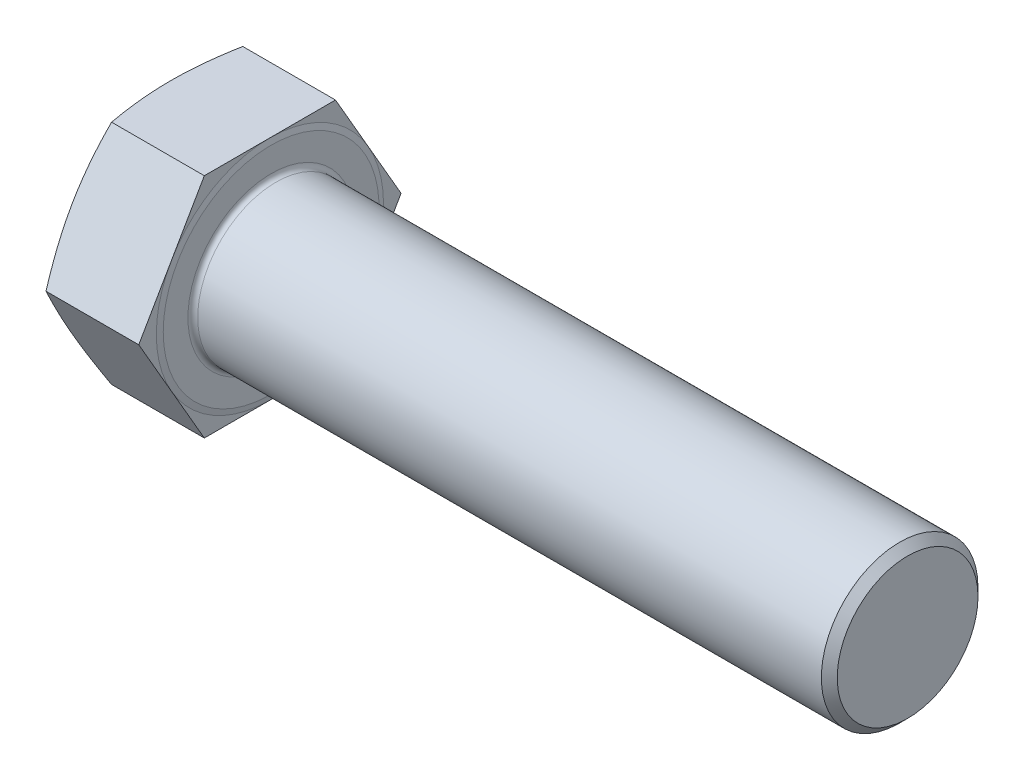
ISO-10303-21;
HEADER;
FILE_DESCRIPTION(('STEP AP214'),'2;1');
FILE_NAME('part.step','',(''),(''),'','','');
FILE_SCHEMA(('AUTOMOTIVE_DESIGN { 1 0 10303 214 1 1 1 1 }'));
ENDSEC;
DATA;
#1=APPLICATION_CONTEXT('core data for automotive mechanical design processes');
#2=APPLICATION_PROTOCOL_DEFINITION('international standard','automotive_design',2000,#1);
#3=PRODUCT_CONTEXT('',#1,'mechanical');
#4=PRODUCT('Part','Part','',(#3));
#5=PRODUCT_RELATED_PRODUCT_CATEGORY('part','',(#4));
#6=PRODUCT_DEFINITION_FORMATION('','',#4);
#7=PRODUCT_DEFINITION_CONTEXT('part definition',#1,'design');
#8=PRODUCT_DEFINITION('design','',#6,#7);
#9=PRODUCT_DEFINITION_SHAPE('','',#8);
#10=(LENGTH_UNIT() NAMED_UNIT(*) SI_UNIT(.MILLI.,.METRE.));
#11=(NAMED_UNIT(*) PLANE_ANGLE_UNIT() SI_UNIT($,.RADIAN.));
#12=(NAMED_UNIT(*) SI_UNIT($,.STERADIAN.) SOLID_ANGLE_UNIT());
#13=UNCERTAINTY_MEASURE_WITH_UNIT(LENGTH_MEASURE(1.E-05),#10,'distance_accuracy_value','');
#14=(GEOMETRIC_REPRESENTATION_CONTEXT(3) GLOBAL_UNCERTAINTY_ASSIGNED_CONTEXT((#13)) GLOBAL_UNIT_ASSIGNED_CONTEXT((#10,
#11,#12)) REPRESENTATION_CONTEXT('',''));
#15=CARTESIAN_POINT('',(0.,0.,0.));
#16=DIRECTION('',(0.,0.,1.));
#17=DIRECTION('',(1.,0.,0.));
#18=AXIS2_PLACEMENT_3D('',#15,#16,#17);
#19=CARTESIAN_POINT('',(41.,0.,0.));
#20=DIRECTION('',(1.,0.,0.));
#21=DIRECTION('',(0.,0.,-1.));
#22=AXIS2_PLACEMENT_3D('',#19,#20,#21);
#23=PLANE('',#22);
#24=CARTESIAN_POINT('',(41.,0.,0.));
#25=DIRECTION('',(1.,0.,0.));
#26=DIRECTION('',(0.,0.,-1.));
#27=AXIS2_PLACEMENT_3D('',#24,#25,#26);
#28=CIRCLE('',#27,34.);
#29=CARTESIAN_POINT('',(41.,0.,-34.));
#30=VERTEX_POINT('',#29);
#31=EDGE_CURVE('E188',#30,#30,#28,.F.);
#32=ORIENTED_EDGE('',*,*,#31,.T.);
#33=EDGE_LOOP('',(#32));
#34=FACE_BOUND('',#33,.T.);
#35=CARTESIAN_POINT('',(41.,0.,0.));
#36=DIRECTION('',(-1.,0.,0.));
#37=DIRECTION('',(0.,0.,1.));
#38=AXIS2_PLACEMENT_3D('',#35,#36,#37);
#39=CIRCLE('',#38,44.08);
#40=CARTESIAN_POINT('',(41.,0.,44.08));
#41=VERTEX_POINT('',#40);
#42=EDGE_CURVE('E138',#41,#41,#39,.T.);
#43=ORIENTED_EDGE('',*,*,#42,.F.);
#44=EDGE_LOOP('',(#43));
#45=FACE_BOUND('',#44,.T.);
#46=ADVANCED_FACE('F33',(#34,#45),#23,.T.);
#47=CARTESIAN_POINT('',(40.5,-92.8,0.));
#48=DIRECTION('',(-1.,0.,0.));
#49=DIRECTION('',(0.,0.,1.));
#50=AXIS2_PLACEMENT_3D('',#47,#48,#49);
#51=PLANE('',#50);
#52=DIRECTION('',(0.,-0.866025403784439,0.5));
#53=VECTOR('',#52,1.);
#54=CARTESIAN_POINT('',(40.5,46.4,26.7890524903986));
#55=LINE('',#54,#53);
#56=CARTESIAN_POINT('',(40.5,46.4,26.7890524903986));
#57=VERTEX_POINT('',#56);
#58=CARTESIAN_POINT('',(40.5,23.2,40.1835787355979));
#59=VERTEX_POINT('',#58);
#60=EDGE_CURVE('E137',#57,#59,#55,.T.);
#61=ORIENTED_EDGE('',*,*,#60,.T.);
#62=CARTESIAN_POINT('',(40.5,0.,0.));
#63=DIRECTION('',(-1.,0.,0.));
#64=DIRECTION('',(0.,0.,1.));
#65=AXIS2_PLACEMENT_3D('',#62,#63,#64);
#66=CIRCLE('',#65,46.4);
#67=CARTESIAN_POINT('',(40.5,46.4,0.));
#68=VERTEX_POINT('',#67);
#69=EDGE_CURVE('E49',#59,#68,#66,.T.);
#70=ORIENTED_EDGE('',*,*,#69,.T.);
#71=DIRECTION('',(0.,0.,1.));
#72=VECTOR('',#71,1.);
#73=CARTESIAN_POINT('',(40.5,46.4,-26.7890524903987));
#74=LINE('',#73,#72);
#75=EDGE_CURVE('E134',#68,#57,#74,.T.);
#76=ORIENTED_EDGE('',*,*,#75,.T.);
#77=EDGE_LOOP('',(#61,#70,#76));
#78=FACE_BOUND('',#77,.T.);
#79=ADVANCED_FACE('F133',(#78),#51,.F.);
#80=CARTESIAN_POINT('',(40.5,46.4,-26.7890524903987));
#81=VERTEX_POINT('',#80);
#82=EDGE_CURVE('E145',#81,#68,#74,.T.);
#83=ORIENTED_EDGE('',*,*,#82,.T.);
#84=CARTESIAN_POINT('',(40.5,23.2,-40.1835787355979));
#85=VERTEX_POINT('',#84);
#86=EDGE_CURVE('E121',#68,#85,#66,.T.);
#87=ORIENTED_EDGE('',*,*,#86,.T.);
#88=DIRECTION('',(0.,0.866025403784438,0.5));
#89=VECTOR('',#88,1.);
#90=CARTESIAN_POINT('',(40.5,0.,-53.5781049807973));
#91=LINE('',#90,#89);
#92=EDGE_CURVE('E151',#85,#81,#91,.T.);
#93=ORIENTED_EDGE('',*,*,#92,.T.);
#94=EDGE_LOOP('',(#83,#87,#93));
#95=FACE_BOUND('',#94,.T.);
#96=ADVANCED_FACE('F150',(#95),#51,.F.);
#97=CARTESIAN_POINT('',(40.5,0.,-53.5781049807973));
#98=VERTEX_POINT('',#97);
#99=EDGE_CURVE('E148',#98,#85,#91,.T.);
#100=ORIENTED_EDGE('',*,*,#99,.T.);
#101=CARTESIAN_POINT('',(40.5,-23.2,-40.1835787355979));
#102=VERTEX_POINT('',#101);
#103=EDGE_CURVE('E124',#85,#102,#66,.T.);
#104=ORIENTED_EDGE('',*,*,#103,.T.);
#105=DIRECTION('',(0.,0.866025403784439,-0.5));
#106=VECTOR('',#105,1.);
#107=CARTESIAN_POINT('',(40.5,-46.4,-26.7890524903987));
#108=LINE('',#107,#106);
#109=EDGE_CURVE('E348',#102,#98,#108,.T.);
#110=ORIENTED_EDGE('',*,*,#109,.T.);
#111=EDGE_LOOP('',(#100,#104,#110));
#112=FACE_BOUND('',#111,.T.);
#113=ADVANCED_FACE('F302',(#112),#51,.F.);
#114=CARTESIAN_POINT('',(40.5,-46.4,-26.7890524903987));
#115=VERTEX_POINT('',#114);
#116=EDGE_CURVE('E316',#115,#102,#108,.T.);
#117=ORIENTED_EDGE('',*,*,#116,.T.);
#118=CARTESIAN_POINT('',(40.5,-46.4,0.));
#119=VERTEX_POINT('',#118);
#120=EDGE_CURVE('E317',#102,#119,#66,.T.);
#121=ORIENTED_EDGE('',*,*,#120,.T.);
#122=DIRECTION('',(0.,0.,-1.));
#123=VECTOR('',#122,1.);
#124=CARTESIAN_POINT('',(40.5,-46.4,26.7890524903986));
#125=LINE('',#124,#123);
#126=EDGE_CURVE('E162',#119,#115,#125,.T.);
#127=ORIENTED_EDGE('',*,*,#126,.T.);
#128=EDGE_LOOP('',(#117,#121,#127));
#129=FACE_BOUND('',#128,.T.);
#130=ADVANCED_FACE('F295',(#129),#51,.F.);
#131=CARTESIAN_POINT('',(40.5,-46.4,26.7890524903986));
#132=VERTEX_POINT('',#131);
#133=EDGE_CURVE('E163',#132,#119,#125,.T.);
#134=ORIENTED_EDGE('',*,*,#133,.T.);
#135=CARTESIAN_POINT('',(40.5,-23.2,40.1835787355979));
#136=VERTEX_POINT('',#135);
#137=EDGE_CURVE('E306',#119,#136,#66,.T.);
#138=ORIENTED_EDGE('',*,*,#137,.T.);
#139=DIRECTION('',(0.,-0.866025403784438,-0.5));
#140=VECTOR('',#139,1.);
#141=CARTESIAN_POINT('',(40.5,0.,53.5781049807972));
#142=LINE('',#141,#140);
#143=EDGE_CURVE('E158',#136,#132,#142,.T.);
#144=ORIENTED_EDGE('',*,*,#143,.T.);
#145=EDGE_LOOP('',(#134,#138,#144));
#146=FACE_BOUND('',#145,.T.);
#147=ADVANCED_FACE('F287',(#146),#51,.F.);
#148=CARTESIAN_POINT('',(40.5,-46.4,-26.7890524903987));
#149=DIRECTION('',(0.,0.5,0.866025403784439));
#150=DIRECTION('',(0.,-0.866025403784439,0.5));
#151=AXIS2_PLACEMENT_3D('',#148,#149,#150);
#152=PLANE('',#151);
#153=CARTESIAN_POINT('',(2.61265857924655,0.00020000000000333,-53.5782204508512));
#154=CARTESIAN_POINT('',(2.41074770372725,-0.960669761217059,-53.0234620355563));
#155=CARTESIAN_POINT('',(2.2179233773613,-1.92300551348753,-52.4678572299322));
#156=CARTESIAN_POINT('',(1.85243292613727,-3.85063249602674,-51.354941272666));
#157=CARTESIAN_POINT('',(1.67976871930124,-4.81592399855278,-50.7976299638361));
#158=CARTESIAN_POINT('',(1.35649942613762,-6.75004117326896,-49.6809668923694));
#159=CARTESIAN_POINT('',(1.20591127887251,-7.71886898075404,-49.1216138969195));
#160=CARTESIAN_POINT('',(0.92895014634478,-9.65910086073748,-48.0014204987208));
#161=CARTESIAN_POINT('',(0.802576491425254,-10.6305048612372,-47.4405801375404));
#162=CARTESIAN_POINT('',(0.576973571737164,-12.5664327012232,-46.3228716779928));
#163=CARTESIAN_POINT('',(0.477499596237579,-13.5309350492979,-45.7660159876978));
#164=CARTESIAN_POINT('',(0.305719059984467,-15.4617674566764,-44.6512493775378));
#165=CARTESIAN_POINT('',(0.233412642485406,-16.4280975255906,-44.0933384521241));
#166=CARTESIAN_POINT('',(0.117224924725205,-18.3616916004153,-42.9769773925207));
#167=CARTESIAN_POINT('',(0.0733332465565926,-19.3289551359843,-42.4185275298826));
#168=CARTESIAN_POINT('',(0.014720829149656,-21.2641457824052,-41.3012446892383));
#169=CARTESIAN_POINT('',(0.,-22.2320728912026,-40.7424117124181));
#170=CARTESIAN_POINT('',(0.,-24.1679271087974,-39.6247457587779));
#171=CARTESIAN_POINT('',(0.0147208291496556,-25.1358542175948,-39.0659127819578));
#172=CARTESIAN_POINT('',(0.0733332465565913,-27.0710448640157,-37.9486299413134));
#173=CARTESIAN_POINT('',(0.117224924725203,-28.0383083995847,-37.3901800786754));
#174=CARTESIAN_POINT('',(0.233412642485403,-29.9719024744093,-36.2738190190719));
#175=CARTESIAN_POINT('',(0.305719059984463,-30.9382325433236,-35.7159080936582));
#176=CARTESIAN_POINT('',(0.477499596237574,-32.8690649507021,-34.6011414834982));
#177=CARTESIAN_POINT('',(0.57697357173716,-33.8335672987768,-34.0442857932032));
#178=CARTESIAN_POINT('',(0.802576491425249,-35.7694951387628,-32.9265773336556));
#179=CARTESIAN_POINT('',(0.928950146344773,-36.7408991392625,-32.3657369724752));
#180=CARTESIAN_POINT('',(1.2059112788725,-38.6811310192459,-31.2455435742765));
#181=CARTESIAN_POINT('',(1.35649942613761,-39.649958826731,-30.6861905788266));
#182=CARTESIAN_POINT('',(1.67976871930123,-41.5840760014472,-29.5695275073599));
#183=CARTESIAN_POINT('',(1.85243292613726,-42.5493675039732,-29.0122161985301));
#184=CARTESIAN_POINT('',(2.2179233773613,-44.4769944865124,-27.8993002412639));
#185=CARTESIAN_POINT('',(2.41074770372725,-45.4393302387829,-27.3436954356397));
#186=CARTESIAN_POINT('',(2.61265857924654,-46.4002,-26.7889370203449));
#187=B_SPLINE_CURVE_WITH_KNOTS('',3,(#153,#154,#155,#156,#157,#158,#159,#160,#161,#162,#163,
#164,#165,#166,#167,#168,#169,#170,#171,#172,#173,#174,#175,#176,#177,#178,#179,#180,#181,#182,
#183,#184,#185,#186),.UNSPECIFIED.,.F.,.F.,(4,2,2,2,2,2,2,2,2,2,2,2,2,2,2,2,4),(0.,
3.38323699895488,6.76679561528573,10.1529370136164,13.5389847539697,16.8931052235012,
20.2472433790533,23.6001558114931,26.9530579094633,30.3059600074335,33.6588724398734,
37.0130105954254,40.3671310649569,43.7531788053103,47.1393202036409,50.5228788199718,
53.9061158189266),.UNSPECIFIED.);
#188=CARTESIAN_POINT('',(2.61261655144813,0.,-53.5781049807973));
#189=VERTEX_POINT('',#188);
#190=CARTESIAN_POINT('',(0.,-23.2,-40.1835787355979));
#191=VERTEX_POINT('',#190);
#192=EDGE_CURVE('E332',#189,#191,#187,.T.);
#193=ORIENTED_EDGE('',*,*,#192,.F.);
#194=DIRECTION('',(-1.,0.,0.));
#195=VECTOR('',#194,1.);
#196=CARTESIAN_POINT('',(40.5,0.,-53.5781049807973));
#197=LINE('',#196,#195);
#198=EDGE_CURVE('E178',#98,#189,#197,.T.);
#199=ORIENTED_EDGE('',*,*,#198,.F.);
#200=ORIENTED_EDGE('',*,*,#109,.F.);
#201=ORIENTED_EDGE('',*,*,#116,.F.);
#202=DIRECTION('',(-1.,0.,0.));
#203=VECTOR('',#202,1.);
#204=CARTESIAN_POINT('',(40.5,-46.4,-26.7890524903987));
#205=LINE('',#204,#203);
#206=CARTESIAN_POINT('',(2.61261655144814,-46.4,-26.7890524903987));
#207=VERTEX_POINT('',#206);
#208=EDGE_CURVE('E166',#115,#207,#205,.T.);
#209=ORIENTED_EDGE('',*,*,#208,.T.);
#210=EDGE_CURVE('E245',#191,#207,#187,.T.);
#211=ORIENTED_EDGE('',*,*,#210,.F.);
#212=EDGE_LOOP('',(#193,#199,#200,#201,#209,#211));
#213=FACE_BOUND('',#212,.T.);
#214=ADVANCED_FACE('F35',(#213),#152,.F.);
#215=CARTESIAN_POINT('',(40.5,0.,-53.5781049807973));
#216=DIRECTION('',(0.,-0.5,0.866025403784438));
#217=DIRECTION('',(0.,-0.866025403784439,-0.5));
#218=AXIS2_PLACEMENT_3D('',#215,#216,#217);
#219=PLANE('',#218);
#220=CARTESIAN_POINT('',(2.61265857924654,46.4002,-26.7889370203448));
#221=CARTESIAN_POINT('',(2.41074770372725,45.4393302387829,-27.3436954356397));
#222=CARTESIAN_POINT('',(2.2179233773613,44.4769944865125,-27.8993002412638));
#223=CARTESIAN_POINT('',(1.85243292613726,42.5493675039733,-29.01221619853));
#224=CARTESIAN_POINT('',(1.67976871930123,41.5840760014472,-29.5695275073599));
#225=CARTESIAN_POINT('',(1.35649942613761,39.649958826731,-30.6861905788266));
#226=CARTESIAN_POINT('',(1.2059112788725,38.681131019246,-31.2455435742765));
#227=CARTESIAN_POINT('',(0.928950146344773,36.7408991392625,-32.3657369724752));
#228=CARTESIAN_POINT('',(0.802576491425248,35.7694951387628,-32.9265773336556));
#229=CARTESIAN_POINT('',(0.576973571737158,33.8335672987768,-34.0442857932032));
#230=CARTESIAN_POINT('',(0.477499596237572,32.8690649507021,-34.6011414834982));
#231=CARTESIAN_POINT('',(0.305719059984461,30.9382325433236,-35.7159080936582));
#232=CARTESIAN_POINT('',(0.233412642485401,29.9719024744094,-36.2738190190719));
#233=CARTESIAN_POINT('',(0.117224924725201,28.0383083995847,-37.3901800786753));
#234=CARTESIAN_POINT('',(0.0733332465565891,27.0710448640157,-37.9486299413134));
#235=CARTESIAN_POINT('',(0.014720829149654,25.1358542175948,-39.0659127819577));
#236=CARTESIAN_POINT('',(0.,24.1679271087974,-39.6247457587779));
#237=CARTESIAN_POINT('',(0.,22.2320728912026,-40.7424117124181));
#238=CARTESIAN_POINT('',(0.0147208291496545,21.2641457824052,-41.3012446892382));
#239=CARTESIAN_POINT('',(0.0733332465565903,19.3289551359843,-42.4185275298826));
#240=CARTESIAN_POINT('',(0.117224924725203,18.3616916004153,-42.9769773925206));
#241=CARTESIAN_POINT('',(0.233412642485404,16.4280975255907,-44.0933384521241));
#242=CARTESIAN_POINT('',(0.305719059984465,15.4617674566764,-44.6512493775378));
#243=CARTESIAN_POINT('',(0.477499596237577,13.5309350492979,-45.7660159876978));
#244=CARTESIAN_POINT('',(0.576973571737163,12.5664327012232,-46.3228716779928));
#245=CARTESIAN_POINT('',(0.802576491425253,10.6305048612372,-47.4405801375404));
#246=CARTESIAN_POINT('',(0.928950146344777,9.6591008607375,-48.0014204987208));
#247=CARTESIAN_POINT('',(1.2059112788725,7.71886898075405,-49.1216138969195));
#248=CARTESIAN_POINT('',(1.35649942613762,6.75004117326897,-49.6809668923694));
#249=CARTESIAN_POINT('',(1.67976871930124,4.8159239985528,-50.7976299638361));
#250=CARTESIAN_POINT('',(1.85243292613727,3.85063249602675,-51.354941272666));
#251=CARTESIAN_POINT('',(2.21792337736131,1.92300551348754,-52.4678572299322));
#252=CARTESIAN_POINT('',(2.41074770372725,0.960669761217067,-53.0234620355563));
#253=CARTESIAN_POINT('',(2.61265857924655,-0.000199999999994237,-53.5782204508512));
#254=B_SPLINE_CURVE_WITH_KNOTS('',3,(#220,#221,#222,#223,#224,#225,#226,#227,#228,#229,#230,
#231,#232,#233,#234,#235,#236,#237,#238,#239,#240,#241,#242,#243,#244,#245,#246,#247,#248,#249,
#250,#251,#252,#253),.UNSPECIFIED.,.F.,.F.,(4,2,2,2,2,2,2,2,2,2,2,2,2,2,2,2,4),(0.,
3.38323699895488,6.76679561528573,10.1529370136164,13.5389847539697,16.8931052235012,
20.2472433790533,23.6001558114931,26.9530579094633,30.3059600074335,33.6588724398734,
37.0130105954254,40.3671310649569,43.7531788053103,47.1393202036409,50.5228788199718,
53.9061158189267),.UNSPECIFIED.);
#255=CARTESIAN_POINT('',(2.61261655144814,46.4,-26.7890524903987));
#256=VERTEX_POINT('',#255);
#257=CARTESIAN_POINT('',(0.,23.2,-40.1835787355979));
#258=VERTEX_POINT('',#257);
#259=EDGE_CURVE('E260',#256,#258,#254,.T.);
#260=ORIENTED_EDGE('',*,*,#259,.F.);
#261=DIRECTION('',(-1.,0.,0.));
#262=VECTOR('',#261,1.);
#263=CARTESIAN_POINT('',(40.5,46.4,-26.7890524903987));
#264=LINE('',#263,#262);
#265=EDGE_CURVE('E176',#81,#256,#264,.T.);
#266=ORIENTED_EDGE('',*,*,#265,.F.);
#267=ORIENTED_EDGE('',*,*,#92,.F.);
#268=ORIENTED_EDGE('',*,*,#99,.F.);
#269=ORIENTED_EDGE('',*,*,#198,.T.);
#270=EDGE_CURVE('E256',#258,#189,#254,.T.);
#271=ORIENTED_EDGE('',*,*,#270,.F.);
#272=EDGE_LOOP('',(#260,#266,#267,#268,#269,#271));
#273=FACE_BOUND('',#272,.T.);
#274=ADVANCED_FACE('F266',(#273),#219,.F.);
#275=CARTESIAN_POINT('',(40.5,46.4,-26.7890524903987));
#276=DIRECTION('',(0.,-1.,0.));
#277=DIRECTION('',(0.,0.,-1.));
#278=AXIS2_PLACEMENT_3D('',#275,#276,#277);
#279=PLANE('',#278);
#280=CARTESIAN_POINT('',(13.9607867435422,46.4,-70.9279913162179));
#281=CARTESIAN_POINT('',(13.6410931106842,46.4,-69.8783553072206));
#282=CARTESIAN_POINT('',(13.3233281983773,46.4,-68.8281300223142));
#283=CARTESIAN_POINT('',(12.6920979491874,46.4,-66.7263817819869));
#284=CARTESIAN_POINT('',(12.3786326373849,46.4,-65.6748588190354));
#285=CARTESIAN_POINT('',(11.7564232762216,46.4,-63.570326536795));
#286=CARTESIAN_POINT('',(11.4476795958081,46.4,-62.5173171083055));
#287=CARTESIAN_POINT('',(10.8354623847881,46.4,-60.4097700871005));
#288=CARTESIAN_POINT('',(10.5319888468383,46.4,-59.3552324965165));
#289=CARTESIAN_POINT('',(9.62919764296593,46.4,-56.1851816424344));
#290=CARTESIAN_POINT('',(9.03867296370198,46.4,-54.0671508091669));
#291=CARTESIAN_POINT('',(7.88667290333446,46.4,-49.8232181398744));
#292=CARTESIAN_POINT('',(7.3251970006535,46.4,-47.6973164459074));
#293=CARTESIAN_POINT('',(6.24521194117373,46.4,-43.4624850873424));
#294=CARTESIAN_POINT('',(5.72625838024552,46.4,-41.3536693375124));
#295=CARTESIAN_POINT('',(4.732532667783,46.4,-37.1255461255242));
#296=CARTESIAN_POINT('',(4.25776125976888,46.4,-35.006238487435));
#297=CARTESIAN_POINT('',(3.36347119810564,46.4,-30.7566495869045));
#298=CARTESIAN_POINT('',(2.94393369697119,46.4,-28.6263723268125));
#299=CARTESIAN_POINT('',(2.17288180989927,46.4,-24.3534707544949));
#300=CARTESIAN_POINT('',(1.82136514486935,46.4,-22.2108468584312));
#301=CARTESIAN_POINT('',(1.23545507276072,46.4,-18.1544265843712));
#302=CARTESIAN_POINT('',(0.992348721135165,46.4,-16.2419085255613));
#303=CARTESIAN_POINT('',(0.683674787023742,46.4,-13.367181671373));
#304=CARTESIAN_POINT('',(0.590113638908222,46.4,-12.4079364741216));
#305=CARTESIAN_POINT('',(0.422702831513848,46.4,-10.487711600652));
#306=CARTESIAN_POINT('',(0.348853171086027,46.4,-9.52673192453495));
#307=CARTESIAN_POINT('',(0.221823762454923,46.4,-7.60407952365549));
#308=CARTESIAN_POINT('',(0.168629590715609,46.4,-6.64240775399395));
#309=CARTESIAN_POINT('',(0.083524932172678,46.4,-4.71811901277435));
#310=CARTESIAN_POINT('',(0.0516144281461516,46.4,-3.75550204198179));
#311=CARTESIAN_POINT('',(0.00950618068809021,46.4,-1.82979493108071));
#312=CARTESIAN_POINT('',(-0.000691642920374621,46.4,-0.866704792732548));
#313=CARTESIAN_POINT('',(0.000764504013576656,46.4,1.05945911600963));
#314=CARTESIAN_POINT('',(0.0124184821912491,46.4,2.02253288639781));
#315=CARTESIAN_POINT('',(0.0575333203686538,46.4,3.95305164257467));
#316=CARTESIAN_POINT('',(0.0911044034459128,46.4,4.92049404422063));
#317=CARTESIAN_POINT('',(0.179704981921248,46.4,6.85439106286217));
#318=CARTESIAN_POINT('',(0.234734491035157,46.4,7.82084567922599));
#319=CARTESIAN_POINT('',(0.365537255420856,46.4,9.75236197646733));
#320=CARTESIAN_POINT('',(0.441310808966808,46.4,10.7174236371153));
#321=CARTESIAN_POINT('',(0.612660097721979,46.4,12.6457680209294));
#322=CARTESIAN_POINT('',(0.70823585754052,46.4,13.6090507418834));
#323=CARTESIAN_POINT('',(1.02322637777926,46.4,16.4974553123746));
#324=CARTESIAN_POINT('',(1.27079544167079,46.4,18.4195733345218));
#325=CARTESIAN_POINT('',(1.69096161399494,46.4,21.2953976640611));
#326=CARTESIAN_POINT('',(1.83915525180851,46.4,22.2527958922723));
#327=CARTESIAN_POINT('',(2.15053663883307,46.4,24.1651663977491));
#328=CARTESIAN_POINT('',(2.31372449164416,46.4,25.1201386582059));
#329=CARTESIAN_POINT('',(2.84186736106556,46.4,28.0822254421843));
#330=CARTESIAN_POINT('',(3.23040458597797,46.4,30.0851524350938));
#331=CARTESIAN_POINT('',(4.05747679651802,46.4,34.0806847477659));
#332=CARTESIAN_POINT('',(4.496015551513,46.4,36.073289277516));
#333=CARTESIAN_POINT('',(5.41389304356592,46.4,40.0496426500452));
#334=CARTESIAN_POINT('',(5.89324362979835,46.4,42.0333887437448));
#335=CARTESIAN_POINT('',(6.88494431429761,46.4,45.9925217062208));
#336=CARTESIAN_POINT('',(7.39729362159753,46.4,47.9679087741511));
#337=CARTESIAN_POINT('',(8.4494994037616,46.4,51.9140353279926));
#338=CARTESIAN_POINT('',(8.98939035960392,46.4,53.8847655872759));
#339=CARTESIAN_POINT('',(10.0911344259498,46.4,57.8200689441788));
#340=CARTESIAN_POINT('',(10.6529876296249,46.4,59.7846420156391));
#341=CARTESIAN_POINT('',(11.7946364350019,46.4,63.7081990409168));
#342=CARTESIAN_POINT('',(12.3744290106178,46.4,65.6671838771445));
#343=CARTESIAN_POINT('',(13.5489293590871,46.4,69.5806651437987));
#344=CARTESIAN_POINT('',(14.1436371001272,46.4,71.5351615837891));
#345=CARTESIAN_POINT('',(15.3388489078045,46.4,75.4187660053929));
#346=CARTESIAN_POINT('',(15.9392164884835,46.4,77.3479160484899));
#347=CARTESIAN_POINT('',(17.1501784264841,46.4,81.2030006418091));
#348=CARTESIAN_POINT('',(17.7607727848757,46.4,83.1289351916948));
#349=CARTESIAN_POINT('',(18.9906524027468,46.4,86.9781223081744));
#350=CARTESIAN_POINT('',(19.609938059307,46.4,88.9013747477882));
#351=CARTESIAN_POINT('',(20.8558989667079,46.4,92.7454849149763));
#352=CARTESIAN_POINT('',(21.4825742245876,46.4,94.6663426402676));
#353=CARTESIAN_POINT('',(22.739876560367,46.4,98.498688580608));
#354=CARTESIAN_POINT('',(23.3704796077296,46.4,100.410184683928));
#355=CARTESIAN_POINT('',(24.6371273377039,46.4,104.231373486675));
#356=CARTESIAN_POINT('',(25.2731720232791,46.4,106.14106618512));
#357=CARTESIAN_POINT('',(26.5499335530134,46.4,109.958714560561));
#358=CARTESIAN_POINT('',(27.1906500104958,46.4,111.866670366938));
#359=CARTESIAN_POINT('',(28.4762287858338,46.4,115.68117978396));
#360=CARTESIAN_POINT('',(29.1210910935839,46.4,117.587733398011));
#361=CARTESIAN_POINT('',(29.767739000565,46.4,119.493679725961));
#362=B_SPLINE_CURVE_WITH_KNOTS('',3,(#280,#281,#282,#283,#284,#285,#286,#287,#288,#289,#290,
#291,#292,#293,#294,#295,#296,#297,#298,#299,#300,#301,#302,#303,#304,#305,#306,#307,#308,#309,
#310,#311,#312,#313,#314,#315,#316,#317,#318,#319,#320,#321,#322,#323,#324,#325,#326,#327,#328,
#329,#330,#331,#332,#333,#334,#335,#336,#337,#338,#339,#340,#341,#342,#343,#344,#345,#346,#347,
#348,#349,#350,#351,#352,#353,#354,#355,#356,#357,#358,#359,#360,#361),.UNSPECIFIED.,.F.,.F.,(4,
2,2,2,2,2,2,2,2,2,2,2,2,2,2,2,2,2,2,2,2,2,2,2,2,2,2,2,2,2,2,2,2,2,2,2,2,2,2,2,4),(0.,
3.29172629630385,6.58347178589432,9.87547319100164,13.1674700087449,19.763731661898,
26.3598748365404,32.8746910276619,39.38961683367,45.9023137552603,52.4147924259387,
58.1970981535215,61.0883188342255,63.9795393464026,66.8687372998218,69.7579329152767,
72.6471178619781,75.5363038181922,78.4401328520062,81.3439637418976,84.2478363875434,
87.1517126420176,92.9641539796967,95.8704695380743,98.7768051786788,104.896726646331,
111.017109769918,117.139275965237,123.261295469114,129.391177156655,135.52108485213,
141.649964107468,147.778830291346,153.840030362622,159.901231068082,165.962709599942,
172.024193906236,178.062669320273,184.101148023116,190.139132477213,196.177102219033),.UNSPECIFIED.);
#363=CARTESIAN_POINT('',(2.61261655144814,46.4000000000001,26.7890524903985));
#364=VERTEX_POINT('',#363);
#365=CARTESIAN_POINT('',(0.,46.4,0.));
#366=VERTEX_POINT('',#365);
#367=EDGE_CURVE('E349',#364,#366,#362,.F.);
#368=ORIENTED_EDGE('',*,*,#367,.F.);
#369=DIRECTION('',(-1.,0.,0.));
#370=VECTOR('',#369,1.);
#371=CARTESIAN_POINT('',(40.5,46.4,26.7890524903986));
#372=LINE('',#371,#370);
#373=EDGE_CURVE('E147',#57,#364,#372,.T.);
#374=ORIENTED_EDGE('',*,*,#373,.F.);
#375=ORIENTED_EDGE('',*,*,#75,.F.);
#376=ORIENTED_EDGE('',*,*,#82,.F.);
#377=ORIENTED_EDGE('',*,*,#265,.T.);
#378=EDGE_CURVE('E261',#366,#256,#362,.F.);
#379=ORIENTED_EDGE('',*,*,#378,.F.);
#380=EDGE_LOOP('',(#368,#374,#375,#376,#377,#379));
#381=FACE_BOUND('',#380,.T.);
#382=ADVANCED_FACE('F143',(#381),#279,.F.);
#383=CARTESIAN_POINT('',(40.5,46.4,26.7890524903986));
#384=DIRECTION('',(0.,-0.5,-0.866025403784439));
#385=DIRECTION('',(0.,0.866025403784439,-0.5));
#386=AXIS2_PLACEMENT_3D('',#383,#384,#385);
#387=PLANE('',#386);
#388=CARTESIAN_POINT('',(2.61265857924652,-0.000200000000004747,53.5782204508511));
#389=CARTESIAN_POINT('',(2.41074770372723,0.960669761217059,53.0234620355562));
#390=CARTESIAN_POINT('',(2.21792337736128,1.92300551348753,52.4678572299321));
#391=CARTESIAN_POINT('',(1.85243292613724,3.85063249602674,51.3549412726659));
#392=CARTESIAN_POINT('',(1.67976871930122,4.81592399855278,50.797629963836));
#393=CARTESIAN_POINT('',(1.3564994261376,6.75004117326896,49.6809668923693));
#394=CARTESIAN_POINT('',(1.20591127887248,7.71886898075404,49.1216138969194));
#395=CARTESIAN_POINT('',(0.928950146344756,9.65910086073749,48.0014204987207));
#396=CARTESIAN_POINT('',(0.80257649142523,10.6305048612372,47.4405801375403));
#397=CARTESIAN_POINT('',(0.57697357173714,12.5664327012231,46.3228716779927));
#398=CARTESIAN_POINT('',(0.477499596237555,13.5309350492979,45.7660159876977));
#399=CARTESIAN_POINT('',(0.305719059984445,15.4617674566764,44.6512493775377));
#400=CARTESIAN_POINT('',(0.233412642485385,16.4280975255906,44.0933384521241));
#401=CARTESIAN_POINT('',(0.117224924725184,18.3616916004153,42.9769773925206));
#402=CARTESIAN_POINT('',(0.0733332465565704,19.3289551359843,42.4185275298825));
#403=CARTESIAN_POINT('',(0.0147208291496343,21.2641457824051,41.3012446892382));
#404=CARTESIAN_POINT('',(0.,22.2320728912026,40.742411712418));
#405=CARTESIAN_POINT('',(0.,24.1679271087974,39.6247457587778));
#406=CARTESIAN_POINT('',(0.0147208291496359,25.1358542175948,39.0659127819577));
#407=CARTESIAN_POINT('',(0.0733332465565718,27.0710448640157,37.9486299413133));
#408=CARTESIAN_POINT('',(0.117224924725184,28.0383083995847,37.3901800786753));
#409=CARTESIAN_POINT('',(0.233412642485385,29.9719024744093,36.2738190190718));
#410=CARTESIAN_POINT('',(0.305719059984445,30.9382325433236,35.7159080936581));
#411=CARTESIAN_POINT('',(0.477499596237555,32.8690649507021,34.6011414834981));
#412=CARTESIAN_POINT('',(0.57697357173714,33.8335672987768,34.0442857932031));
#413=CARTESIAN_POINT('',(0.80257649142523,35.7694951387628,32.9265773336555));
#414=CARTESIAN_POINT('',(0.928950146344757,36.7408991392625,32.3657369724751));
#415=CARTESIAN_POINT('',(1.20591127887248,38.6811310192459,31.2455435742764));
#416=CARTESIAN_POINT('',(1.3564994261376,39.649958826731,30.6861905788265));
#417=CARTESIAN_POINT('',(1.67976871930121,41.5840760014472,29.5695275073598));
#418=CARTESIAN_POINT('',(1.85243292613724,42.5493675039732,29.01221619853));
#419=CARTESIAN_POINT('',(2.21792337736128,44.4769944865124,27.8993002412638));
#420=CARTESIAN_POINT('',(2.41074770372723,45.4393302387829,27.3436954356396));
#421=CARTESIAN_POINT('',(2.61265857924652,46.4002,26.7889370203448));
#422=B_SPLINE_CURVE_WITH_KNOTS('',3,(#388,#389,#390,#391,#392,#393,#394,#395,#396,#397,#398,
#399,#400,#401,#402,#403,#404,#405,#406,#407,#408,#409,#410,#411,#412,#413,#414,#415,#416,#417,
#418,#419,#420,#421),.UNSPECIFIED.,.F.,.F.,(4,2,2,2,2,2,2,2,2,2,2,2,2,2,2,2,4),(0.,
3.38323699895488,6.76679561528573,10.1529370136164,13.5389847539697,16.8931052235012,
20.2472433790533,23.6001558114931,26.9530579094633,30.3059600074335,33.6588724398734,
37.0130105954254,40.3671310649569,43.7531788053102,47.1393202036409,50.5228788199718,
53.9061158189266),.UNSPECIFIED.);
#423=CARTESIAN_POINT('',(2.61261655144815,1.45716771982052E-13,53.5781049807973));
#424=VERTEX_POINT('',#423);
#425=CARTESIAN_POINT('',(0.,23.2,40.183578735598));
#426=VERTEX_POINT('',#425);
#427=EDGE_CURVE('E250',#424,#426,#422,.T.);
#428=ORIENTED_EDGE('',*,*,#427,.F.);
#429=DIRECTION('',(-1.,0.,0.));
#430=VECTOR('',#429,1.);
#431=CARTESIAN_POINT('',(40.5,0.,53.5781049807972));
#432=LINE('',#431,#430);
#433=CARTESIAN_POINT('',(40.5,0.,53.5781049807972));
#434=VERTEX_POINT('',#433);
#435=EDGE_CURVE('E172',#434,#424,#432,.T.);
#436=ORIENTED_EDGE('',*,*,#435,.F.);
#437=EDGE_CURVE('E153',#59,#434,#55,.T.);
#438=ORIENTED_EDGE('',*,*,#437,.F.);
#439=ORIENTED_EDGE('',*,*,#60,.F.);
#440=ORIENTED_EDGE('',*,*,#373,.T.);
#441=EDGE_CURVE('E335',#426,#364,#422,.T.);
#442=ORIENTED_EDGE('',*,*,#441,.F.);
#443=EDGE_LOOP('',(#428,#436,#438,#439,#440,#442));
#444=FACE_BOUND('',#443,.T.);
#445=ADVANCED_FACE('F272',(#444),#387,.F.);
#446=CARTESIAN_POINT('',(40.5,0.,53.5781049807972));
#447=DIRECTION('',(0.,0.5,-0.866025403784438));
#448=DIRECTION('',(0.,0.866025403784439,0.5));
#449=AXIS2_PLACEMENT_3D('',#446,#447,#448);
#450=PLANE('',#449);
#451=CARTESIAN_POINT('',(2.61265857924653,-46.4002,26.7889370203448));
#452=CARTESIAN_POINT('',(2.41074770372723,-45.4393302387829,27.3436954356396));
#453=CARTESIAN_POINT('',(2.21792337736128,-44.4769944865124,27.8993002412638));
#454=CARTESIAN_POINT('',(1.85243292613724,-42.5493675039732,29.01221619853));
#455=CARTESIAN_POINT('',(1.67976871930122,-41.5840760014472,29.5695275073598));
#456=CARTESIAN_POINT('',(1.3564994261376,-39.649958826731,30.6861905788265));
#457=CARTESIAN_POINT('',(1.20591127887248,-38.6811310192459,31.2455435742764));
#458=CARTESIAN_POINT('',(0.928950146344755,-36.7408991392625,32.3657369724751));
#459=CARTESIAN_POINT('',(0.802576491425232,-35.7694951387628,32.9265773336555));
#460=CARTESIAN_POINT('',(0.576973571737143,-33.8335672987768,34.0442857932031));
#461=CARTESIAN_POINT('',(0.477499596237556,-32.8690649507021,34.6011414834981));
#462=CARTESIAN_POINT('',(0.305719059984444,-30.9382325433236,35.7159080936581));
#463=CARTESIAN_POINT('',(0.233412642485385,-29.9719024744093,36.2738190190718));
#464=CARTESIAN_POINT('',(0.117224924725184,-28.0383083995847,37.3901800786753));
#465=CARTESIAN_POINT('',(0.0733332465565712,-27.0710448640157,37.9486299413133));
#466=CARTESIAN_POINT('',(0.0147208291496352,-25.1358542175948,39.0659127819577));
#467=CARTESIAN_POINT('',(0.,-24.1679271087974,39.6247457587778));
#468=CARTESIAN_POINT('',(0.,-22.2320728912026,40.742411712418));
#469=CARTESIAN_POINT('',(0.0147208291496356,-21.2641457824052,41.3012446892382));
#470=CARTESIAN_POINT('',(0.0733332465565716,-19.3289551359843,42.4185275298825));
#471=CARTESIAN_POINT('',(0.117224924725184,-18.3616916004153,42.9769773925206));
#472=CARTESIAN_POINT('',(0.233412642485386,-16.4280975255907,44.0933384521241));
#473=CARTESIAN_POINT('',(0.305719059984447,-15.4617674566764,44.6512493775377));
#474=CARTESIAN_POINT('',(0.477499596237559,-13.5309350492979,45.7660159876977));
#475=CARTESIAN_POINT('',(0.576973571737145,-12.5664327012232,46.3228716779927));
#476=CARTESIAN_POINT('',(0.802576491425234,-10.6305048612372,47.4405801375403));
#477=CARTESIAN_POINT('',(0.928950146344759,-9.65910086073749,48.0014204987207));
#478=CARTESIAN_POINT('',(1.20591127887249,-7.71886898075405,49.1216138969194));
#479=CARTESIAN_POINT('',(1.3564994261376,-6.75004117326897,49.6809668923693));
#480=CARTESIAN_POINT('',(1.67976871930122,-4.81592399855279,50.797629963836));
#481=CARTESIAN_POINT('',(1.85243292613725,-3.85063249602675,51.3549412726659));
#482=CARTESIAN_POINT('',(2.21792337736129,-1.92300551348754,52.4678572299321));
#483=CARTESIAN_POINT('',(2.41074770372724,-0.960669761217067,53.0234620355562));
#484=CARTESIAN_POINT('',(2.61265857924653,0.000199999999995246,53.5782204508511));
#485=B_SPLINE_CURVE_WITH_KNOTS('',3,(#451,#452,#453,#454,#455,#456,#457,#458,#459,#460,#461,
#462,#463,#464,#465,#466,#467,#468,#469,#470,#471,#472,#473,#474,#475,#476,#477,#478,#479,#480,
#481,#482,#483,#484),.UNSPECIFIED.,.F.,.F.,(4,2,2,2,2,2,2,2,2,2,2,2,2,2,2,2,4),(0.,
3.38323699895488,6.76679561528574,10.1529370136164,13.5389847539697,16.8931052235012,
20.2472433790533,23.6001558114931,26.9530579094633,30.3059600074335,33.6588724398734,
37.0130105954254,40.367131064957,43.7531788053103,47.1393202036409,50.5228788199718,
53.9061158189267),.UNSPECIFIED.);
#486=CARTESIAN_POINT('',(2.61261655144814,-46.4,26.7890524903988));
#487=VERTEX_POINT('',#486);
#488=CARTESIAN_POINT('',(0.,-23.2,40.1835787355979));
#489=VERTEX_POINT('',#488);
#490=EDGE_CURVE('E238',#487,#489,#485,.T.);
#491=ORIENTED_EDGE('',*,*,#490,.F.);
#492=DIRECTION('',(-1.,0.,0.));
#493=VECTOR('',#492,1.);
#494=CARTESIAN_POINT('',(40.5,-46.4,26.7890524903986));
#495=LINE('',#494,#493);
#496=EDGE_CURVE('E169',#132,#487,#495,.T.);
#497=ORIENTED_EDGE('',*,*,#496,.F.);
#498=ORIENTED_EDGE('',*,*,#143,.F.);
#499=EDGE_CURVE('E159',#434,#136,#142,.T.);
#500=ORIENTED_EDGE('',*,*,#499,.F.);
#501=ORIENTED_EDGE('',*,*,#435,.T.);
#502=EDGE_CURVE('E330',#489,#424,#485,.T.);
#503=ORIENTED_EDGE('',*,*,#502,.F.);
#504=EDGE_LOOP('',(#491,#497,#498,#500,#501,#503));
#505=FACE_BOUND('',#504,.T.);
#506=ADVANCED_FACE('F275',(#505),#450,.F.);
#507=CARTESIAN_POINT('',(40.5,-46.4,26.7890524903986));
#508=DIRECTION('',(0.,1.,0.));
#509=DIRECTION('',(0.,0.,1.));
#510=AXIS2_PLACEMENT_3D('',#507,#508,#509);
#511=PLANE('',#510);
#512=CARTESIAN_POINT('',(13.9607867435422,-46.4,-70.927991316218));
#513=CARTESIAN_POINT('',(13.6410931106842,-46.4,-69.8783553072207));
#514=CARTESIAN_POINT('',(13.3233281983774,-46.4,-68.8281300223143));
#515=CARTESIAN_POINT('',(12.6920979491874,-46.4,-66.726381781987));
#516=CARTESIAN_POINT('',(12.378632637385,-46.4,-65.6748588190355));
#517=CARTESIAN_POINT('',(11.7564232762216,-46.4,-63.5703265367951));
#518=CARTESIAN_POINT('',(11.4476795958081,-46.4,-62.5173171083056));
#519=CARTESIAN_POINT('',(10.8354623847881,-46.4,-60.4097700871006));
#520=CARTESIAN_POINT('',(10.5319888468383,-46.4,-59.3552324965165));
#521=CARTESIAN_POINT('',(9.62919764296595,-46.4,-56.1851816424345));
#522=CARTESIAN_POINT('',(9.03867296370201,-46.4,-54.067150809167));
#523=CARTESIAN_POINT('',(7.88667290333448,-46.4,-49.8232181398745));
#524=CARTESIAN_POINT('',(7.32519700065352,-46.4,-47.6973164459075));
#525=CARTESIAN_POINT('',(6.24521194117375,-46.4,-43.4624850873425));
#526=CARTESIAN_POINT('',(5.72625838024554,-46.4,-41.3536693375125));
#527=CARTESIAN_POINT('',(4.73253266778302,-46.4,-37.1255461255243));
#528=CARTESIAN_POINT('',(4.25776125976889,-46.4,-35.006238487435));
#529=CARTESIAN_POINT('',(3.36347119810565,-46.4,-30.7566495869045));
#530=CARTESIAN_POINT('',(2.9439336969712,-46.4,-28.6263723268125));
#531=CARTESIAN_POINT('',(2.17288180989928,-46.4,-24.3534707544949));
#532=CARTESIAN_POINT('',(1.82136514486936,-46.4,-22.2108468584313));
#533=CARTESIAN_POINT('',(1.23545507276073,-46.4,-18.1544265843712));
#534=CARTESIAN_POINT('',(0.992348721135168,-46.4,-16.2419085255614));
#535=CARTESIAN_POINT('',(0.683674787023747,-46.4,-13.367181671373));
#536=CARTESIAN_POINT('',(0.590113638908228,-46.4,-12.4079364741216));
#537=CARTESIAN_POINT('',(0.422702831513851,-46.4,-10.4877116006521));
#538=CARTESIAN_POINT('',(0.348853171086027,-46.4,-9.52673192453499));
#539=CARTESIAN_POINT('',(0.221823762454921,-46.4,-7.60407952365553));
#540=CARTESIAN_POINT('',(0.168629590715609,-46.4,-6.64240775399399));
#541=CARTESIAN_POINT('',(0.0835249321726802,-46.4,-4.71811901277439));
#542=CARTESIAN_POINT('',(0.0516144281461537,-46.4,-3.75550204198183));
#543=CARTESIAN_POINT('',(0.00950618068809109,-46.4,-1.82979493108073));
#544=CARTESIAN_POINT('',(-0.000691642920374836,-46.4,-0.866704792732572));
#545=CARTESIAN_POINT('',(0.000764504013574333,-46.4,1.05945911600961));
#546=CARTESIAN_POINT('',(0.0124184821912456,-46.4,2.02253288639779));
#547=CARTESIAN_POINT('',(0.0575333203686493,-46.4,3.95305164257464));
#548=CARTESIAN_POINT('',(0.0911044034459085,-46.4,4.92049404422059));
#549=CARTESIAN_POINT('',(0.179704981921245,-46.4,6.85439106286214));
#550=CARTESIAN_POINT('',(0.234734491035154,-46.4,7.82084567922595));
#551=CARTESIAN_POINT('',(0.365537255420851,-46.4,9.75236197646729));
#552=CARTESIAN_POINT('',(0.441310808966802,-46.4,10.7174236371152));
#553=CARTESIAN_POINT('',(0.612660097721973,-46.4,12.6457680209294));
#554=CARTESIAN_POINT('',(0.708235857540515,-46.4,13.6090507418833));
#555=CARTESIAN_POINT('',(1.02322637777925,-46.4,16.4974553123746));
#556=CARTESIAN_POINT('',(1.27079544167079,-46.4,18.4195733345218));
#557=CARTESIAN_POINT('',(1.69096161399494,-46.4,21.2953976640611));
#558=CARTESIAN_POINT('',(1.83915525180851,-46.4,22.2527958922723));
#559=CARTESIAN_POINT('',(2.15053663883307,-46.4,24.165166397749));
#560=CARTESIAN_POINT('',(2.31372449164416,-46.4,25.1201386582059));
#561=CARTESIAN_POINT('',(2.84186736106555,-46.4,28.0822254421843));
#562=CARTESIAN_POINT('',(3.23040458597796,-46.4,30.0851524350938));
#563=CARTESIAN_POINT('',(4.05747679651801,-46.4,34.0806847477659));
#564=CARTESIAN_POINT('',(4.496015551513,-46.4,36.073289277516));
#565=CARTESIAN_POINT('',(5.41389304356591,-46.4,40.0496426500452));
#566=CARTESIAN_POINT('',(5.89324362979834,-46.4,42.0333887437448));
#567=CARTESIAN_POINT('',(6.88494431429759,-46.4,45.9925217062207));
#568=CARTESIAN_POINT('',(7.39729362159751,-46.4,47.9679087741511));
#569=CARTESIAN_POINT('',(8.44949940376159,-46.4,51.9140353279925));
#570=CARTESIAN_POINT('',(8.9893903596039,-46.4,53.8847655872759));
#571=CARTESIAN_POINT('',(10.0911344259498,-46.4,57.8200689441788));
#572=CARTESIAN_POINT('',(10.6529876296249,-46.4,59.7846420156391));
#573=CARTESIAN_POINT('',(11.7946364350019,-46.4,63.7081990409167));
#574=CARTESIAN_POINT('',(12.3744290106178,-46.4,65.6671838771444));
#575=CARTESIAN_POINT('',(13.5489293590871,-46.4,69.5806651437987));
#576=CARTESIAN_POINT('',(14.1436371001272,-46.4,71.535161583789));
#577=CARTESIAN_POINT('',(15.3388489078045,-46.4,75.4187660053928));
#578=CARTESIAN_POINT('',(15.9392164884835,-46.4,77.3479160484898));
#579=CARTESIAN_POINT('',(17.1501784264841,-46.4,81.203000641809));
#580=CARTESIAN_POINT('',(17.7607727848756,-46.4,83.1289351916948));
#581=CARTESIAN_POINT('',(18.9906524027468,-46.4,86.9781223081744));
#582=CARTESIAN_POINT('',(19.609938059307,-46.4,88.9013747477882));
#583=CARTESIAN_POINT('',(20.8558989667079,-46.4,92.7454849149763));
#584=CARTESIAN_POINT('',(21.4825742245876,-46.4,94.6663426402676));
#585=CARTESIAN_POINT('',(22.7398765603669,-46.4,98.4986885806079));
#586=CARTESIAN_POINT('',(23.3704796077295,-46.4,100.410184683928));
#587=CARTESIAN_POINT('',(24.6371273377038,-46.4,104.231373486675));
#588=CARTESIAN_POINT('',(25.2731720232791,-46.4,106.14106618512));
#589=CARTESIAN_POINT('',(26.5499335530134,-46.4,109.958714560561));
#590=CARTESIAN_POINT('',(27.1906500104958,-46.4,111.866670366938));
#591=CARTESIAN_POINT('',(28.4762287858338,-46.4,115.68117978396));
#592=CARTESIAN_POINT('',(29.1210910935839,-46.4,117.587733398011));
#593=CARTESIAN_POINT('',(29.767739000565,-46.4,119.493679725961));
#594=B_SPLINE_CURVE_WITH_KNOTS('',3,(#512,#513,#514,#515,#516,#517,#518,#519,#520,#521,#522,
#523,#524,#525,#526,#527,#528,#529,#530,#531,#532,#533,#534,#535,#536,#537,#538,#539,#540,#541,
#542,#543,#544,#545,#546,#547,#548,#549,#550,#551,#552,#553,#554,#555,#556,#557,#558,#559,#560,
#561,#562,#563,#564,#565,#566,#567,#568,#569,#570,#571,#572,#573,#574,#575,#576,#577,#578,#579,
#580,#581,#582,#583,#584,#585,#586,#587,#588,#589,#590,#591,#592,#593),.UNSPECIFIED.,.F.,.F.,(4,
2,2,2,2,2,2,2,2,2,2,2,2,2,2,2,2,2,2,2,2,2,2,2,2,2,2,2,2,2,2,2,2,2,2,2,2,2,2,2,4),(0.,
3.29172629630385,6.58347178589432,9.87547319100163,13.1674700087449,19.763731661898,
26.3598748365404,32.874691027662,39.38961683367,45.9023137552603,52.4147924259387,
58.1970981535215,61.0883188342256,63.9795393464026,66.8687372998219,69.7579329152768,
72.6471178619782,75.5363038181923,78.4401328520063,81.3439637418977,84.2478363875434,
87.1517126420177,92.9641539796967,95.8704695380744,98.7768051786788,104.896726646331,
111.017109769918,117.139275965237,123.261295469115,129.391177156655,135.52108485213,
141.649964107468,147.778830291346,153.840030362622,159.901231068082,165.962709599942,
172.024193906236,178.062669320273,184.101148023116,190.139132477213,196.177102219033),.UNSPECIFIED.);
#595=CARTESIAN_POINT('',(0.,-46.4,0.));
#596=VERTEX_POINT('',#595);
#597=EDGE_CURVE('E323',#207,#596,#594,.T.);
#598=ORIENTED_EDGE('',*,*,#597,.F.);
#599=ORIENTED_EDGE('',*,*,#208,.F.);
#600=ORIENTED_EDGE('',*,*,#126,.F.);
#601=ORIENTED_EDGE('',*,*,#133,.F.);
#602=ORIENTED_EDGE('',*,*,#496,.T.);
#603=EDGE_CURVE('E228',#596,#487,#594,.T.);
#604=ORIENTED_EDGE('',*,*,#603,.F.);
#605=EDGE_LOOP('',(#598,#599,#600,#601,#602,#604));
#606=FACE_BOUND('',#605,.T.);
#607=ADVANCED_FACE('F279',(#606),#511,.F.);
#608=ORIENTED_EDGE('',*,*,#499,.T.);
#609=EDGE_CURVE('E139',#136,#59,#66,.T.);
#610=ORIENTED_EDGE('',*,*,#609,.T.);
#611=ORIENTED_EDGE('',*,*,#437,.T.);
#612=EDGE_LOOP('',(#608,#610,#611));
#613=FACE_BOUND('',#612,.T.);
#614=ADVANCED_FACE('F213',(#613),#51,.F.);
#615=CARTESIAN_POINT('',(0.,0.,0.));
#616=DIRECTION('',(1.,0.,0.));
#617=DIRECTION('',(0.,0.,-1.));
#618=AXIS2_PLACEMENT_3D('',#615,#616,#617);
#619=CONICAL_SURFACE('',#618,46.4,1.22173047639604);
#620=ORIENTED_EDGE('',*,*,#427,.T.);
#621=CARTESIAN_POINT('',(0.,0.,0.));
#622=DIRECTION('',(-1.,0.,0.));
#623=DIRECTION('',(0.,0.,1.));
#624=AXIS2_PLACEMENT_3D('',#621,#622,#623);
#625=CIRCLE('',#624,46.4);
#626=EDGE_CURVE('E181',#489,#426,#625,.T.);
#627=ORIENTED_EDGE('',*,*,#626,.F.);
#628=ORIENTED_EDGE('',*,*,#502,.T.);
#629=EDGE_LOOP('',(#620,#627,#628));
#630=FACE_BOUND('',#629,.T.);
#631=ADVANCED_FACE('F285',(#630),#619,.T.);
#632=ORIENTED_EDGE('',*,*,#490,.T.);
#633=EDGE_CURVE('E184',#596,#489,#625,.T.);
#634=ORIENTED_EDGE('',*,*,#633,.F.);
#635=ORIENTED_EDGE('',*,*,#603,.T.);
#636=EDGE_LOOP('',(#632,#634,#635));
#637=FACE_BOUND('',#636,.T.);
#638=ADVANCED_FACE('F224',(#637),#619,.T.);
#639=ORIENTED_EDGE('',*,*,#210,.T.);
#640=ORIENTED_EDGE('',*,*,#597,.T.);
#641=EDGE_CURVE('E344',#191,#596,#625,.T.);
#642=ORIENTED_EDGE('',*,*,#641,.F.);
#643=EDGE_LOOP('',(#639,#640,#642));
#644=FACE_BOUND('',#643,.T.);
#645=ADVANCED_FACE('F292',(#644),#619,.T.);
#646=ORIENTED_EDGE('',*,*,#270,.T.);
#647=ORIENTED_EDGE('',*,*,#192,.T.);
#648=EDGE_CURVE('E340',#258,#191,#625,.T.);
#649=ORIENTED_EDGE('',*,*,#648,.F.);
#650=EDGE_LOOP('',(#646,#647,#649));
#651=FACE_BOUND('',#650,.T.);
#652=ADVANCED_FACE('F293',(#651),#619,.T.);
#653=ORIENTED_EDGE('',*,*,#378,.T.);
#654=ORIENTED_EDGE('',*,*,#259,.T.);
#655=EDGE_CURVE('E185',#366,#258,#625,.T.);
#656=ORIENTED_EDGE('',*,*,#655,.F.);
#657=EDGE_LOOP('',(#653,#654,#656));
#658=FACE_BOUND('',#657,.T.);
#659=ADVANCED_FACE('F223',(#658),#619,.T.);
#660=ORIENTED_EDGE('',*,*,#367,.T.);
#661=CARTESIAN_POINT('',(0.,0.,0.));
#662=DIRECTION('',(-1.,0.,0.));
#663=DIRECTION('',(0.,0.,1.));
#664=AXIS2_PLACEMENT_3D('',#661,#662,#663);
#665=CIRCLE('',#664,46.4);
#666=EDGE_CURVE('E57',#426,#366,#665,.T.);
#667=ORIENTED_EDGE('',*,*,#666,.F.);
#668=ORIENTED_EDGE('',*,*,#441,.T.);
#669=EDGE_LOOP('',(#660,#667,#668));
#670=FACE_BOUND('',#669,.T.);
#671=ADVANCED_FACE('F218',(#670),#619,.T.);
#672=CARTESIAN_POINT('',(0.,-92.8,0.));
#673=DIRECTION('',(-1.,0.,0.));
#674=DIRECTION('',(0.,0.,1.));
#675=AXIS2_PLACEMENT_3D('',#672,#673,#674);
#676=PLANE('',#675);
#677=ORIENTED_EDGE('',*,*,#626,.T.);
#678=ORIENTED_EDGE('',*,*,#666,.T.);
#679=ORIENTED_EDGE('',*,*,#655,.T.);
#680=ORIENTED_EDGE('',*,*,#648,.T.);
#681=ORIENTED_EDGE('',*,*,#641,.T.);
#682=ORIENTED_EDGE('',*,*,#633,.T.);
#683=EDGE_LOOP('',(#677,#678,#679,#680,#681,#682));
#684=FACE_BOUND('',#683,.T.);
#685=ADVANCED_FACE('F222',(#684),#676,.T.);
#686=CARTESIAN_POINT('',(40.5,0.,0.));
#687=DIRECTION('',(-1.,0.,0.));
#688=DIRECTION('',(0.,0.,1.));
#689=AXIS2_PLACEMENT_3D('',#686,#687,#688);
#690=CONICAL_SURFACE('',#689,46.4,1.3585258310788);
#691=ORIENTED_EDGE('',*,*,#42,.T.);
#692=EDGE_LOOP('',(#691));
#693=FACE_BOUND('',#692,.T.);
#694=ORIENTED_EDGE('',*,*,#69,.F.);
#695=ORIENTED_EDGE('',*,*,#609,.F.);
#696=ORIENTED_EDGE('',*,*,#137,.F.);
#697=ORIENTED_EDGE('',*,*,#120,.F.);
#698=ORIENTED_EDGE('',*,*,#103,.F.);
#699=ORIENTED_EDGE('',*,*,#86,.F.);
#700=EDGE_LOOP('',(#694,#695,#696,#697,#698,#699));
#701=FACE_BOUND('',#700,.T.);
#702=ADVANCED_FACE('F122',(#693,#701),#690,.T.);
#703=CARTESIAN_POINT('',(301.,0.,0.));
#704=DIRECTION('',(-1.,0.,0.));
#705=DIRECTION('',(0.,0.,1.));
#706=AXIS2_PLACEMENT_3D('',#703,#704,#705);
#707=CYLINDRICAL_SURFACE('',#706,32.);
#708=CARTESIAN_POINT('',(297.7525,0.,0.));
#709=DIRECTION('',(1.,0.,0.));
#710=DIRECTION('',(0.,0.,-1.));
#711=AXIS2_PLACEMENT_3D('',#708,#709,#710);
#712=CIRCLE('',#711,32.);
#713=CARTESIAN_POINT('',(297.7525,0.,-32.));
#714=VERTEX_POINT('',#713);
#715=EDGE_CURVE('E12',#714,#714,#712,.F.);
#716=ORIENTED_EDGE('',*,*,#715,.T.);
#717=EDGE_LOOP('',(#716));
#718=FACE_BOUND('',#717,.T.);
#719=CARTESIAN_POINT('',(43.,0.,0.));
#720=DIRECTION('',(1.,0.,0.));
#721=DIRECTION('',(0.,0.,-1.));
#722=AXIS2_PLACEMENT_3D('',#719,#720,#721);
#723=CIRCLE('',#722,32.);
#724=CARTESIAN_POINT('',(43.,0.,-32.));
#725=VERTEX_POINT('',#724);
#726=EDGE_CURVE('E128',#725,#725,#723,.T.);
#727=ORIENTED_EDGE('',*,*,#726,.T.);
#728=EDGE_LOOP('',(#727));
#729=FACE_BOUND('',#728,.T.);
#730=ADVANCED_FACE('F387',(#718,#729),#707,.T.);
#731=CARTESIAN_POINT('',(301.,0.,0.));
#732=DIRECTION('',(1.,0.,0.));
#733=DIRECTION('',(0.,0.,-1.));
#734=AXIS2_PLACEMENT_3D('',#731,#732,#733);
#735=PLANE('',#734);
#736=CARTESIAN_POINT('',(301.,0.,0.));
#737=DIRECTION('',(1.,0.,0.));
#738=DIRECTION('',(0.,0.,-1.));
#739=AXIS2_PLACEMENT_3D('',#736,#737,#738);
#740=CIRCLE('',#739,28.7525000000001);
#741=CARTESIAN_POINT('',(301.,0.,-28.7525000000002));
#742=VERTEX_POINT('',#741);
#743=EDGE_CURVE('E42',#742,#742,#740,.T.);
#744=ORIENTED_EDGE('',*,*,#743,.T.);
#745=EDGE_LOOP('',(#744));
#746=FACE_BOUND('',#745,.T.);
#747=ADVANCED_FACE('F193',(#746),#735,.T.);
#748=CARTESIAN_POINT('',(43.,0.,0.));
#749=DIRECTION('',(1.,0.,0.));
#750=DIRECTION('',(0.,0.,-1.));
#751=AXIS2_PLACEMENT_3D('',#748,#749,#750);
#752=TOROIDAL_SURFACE('',#751,34.,2.);
#753=ORIENTED_EDGE('',*,*,#31,.F.);
#754=EDGE_LOOP('',(#753));
#755=FACE_BOUND('',#754,.T.);
#756=ORIENTED_EDGE('',*,*,#726,.F.);
#757=EDGE_LOOP('',(#756));
#758=FACE_BOUND('',#757,.T.);
#759=ADVANCED_FACE('F197',(#755,#758),#752,.F.);
#760=CARTESIAN_POINT('',(301.,0.,0.));
#761=DIRECTION('',(-1.,0.,0.));
#762=DIRECTION('',(0.,0.,1.));
#763=AXIS2_PLACEMENT_3D('',#760,#761,#762);
#764=CONICAL_SURFACE('',#763,28.7525000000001,0.785398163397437);
#765=ORIENTED_EDGE('',*,*,#715,.F.);
#766=EDGE_LOOP('',(#765));
#767=FACE_BOUND('',#766,.T.);
#768=ORIENTED_EDGE('',*,*,#743,.F.);
#769=EDGE_LOOP('',(#768));
#770=FACE_BOUND('',#769,.T.);
#771=ADVANCED_FACE('F195',(#767,#770),#764,.T.);
#772=CLOSED_SHELL('',(#46,#79,#96,#113,#130,#147,#214,#274,#382,#445,#506,#607,#614,#631,#638,
#645,#652,#659,#671,#685,#702,#730,#747,#759,#771));
#773=MANIFOLD_SOLID_BREP('B2',#772);
#774=ADVANCED_BREP_SHAPE_REPRESENTATION('',(#18,#773),#14);
#775=SHAPE_DEFINITION_REPRESENTATION(#9,#774);
ENDSEC;
END-ISO-10303-21;
